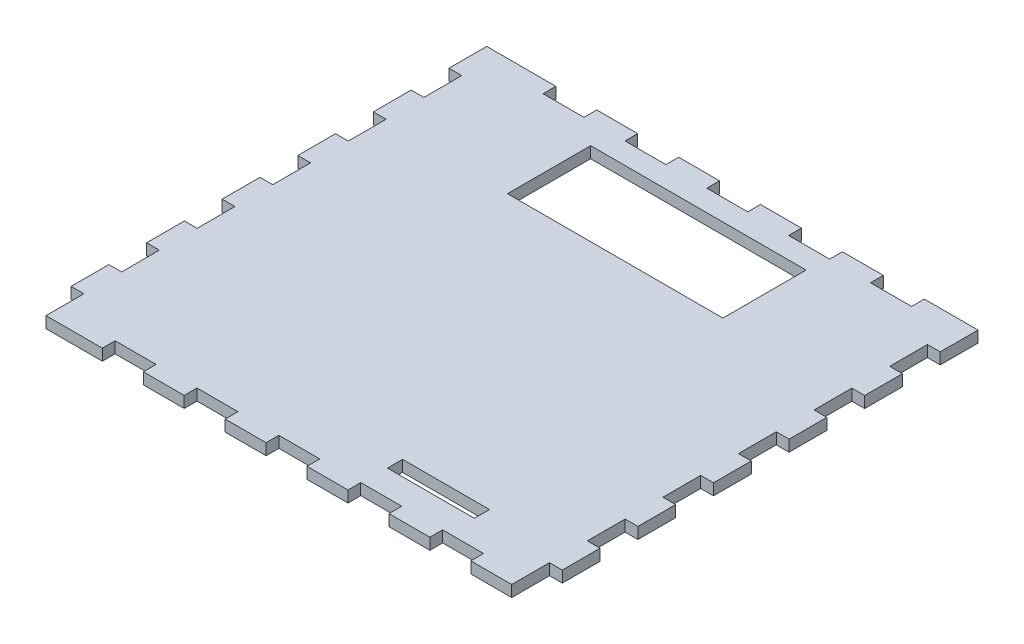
from build123d import *

# Parameters (mm, degrees)
SKETCH1_W           = 130
SKETCH1_H           = 120
SKETCH1_W_2         = 23
SKETCH1_H_2         = 4
BOSS_EXTRUDE1_DEPTH = 3
SKETCH3_W           = 57
SKETCH3_H           = 22
CUT_EXTRUDE1_DEPTH  = 3
SKETCH4_W           = 3.38
SKETCH4_H           = 10
CUT_EXTRUDE2_DEPTH  = 3
SKETCH5_W           = 10.833333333
SKETCH5_H           = 3.38
SKETCH5_W_2         = 10.833333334
CUT_EXTRUDE3_DEPTH  = 3


with BuildPart() as part:
    # Sketch1 → Boss-Extrude1 (new body)
    with BuildSketch(Plane(origin=(0, 0, 0), x_dir=(1, 0, 0), z_dir=(0, 1, 0))):
        Rectangle(SKETCH1_W, SKETCH1_H)
        with Locations((30, -47.764150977)):
            Rectangle(SKETCH1_W_2, SKETCH1_H_2, mode=Mode.SUBTRACT)
    extrude(amount=BOSS_EXTRUDE1_DEPTH)

    # Sketch3 → Cut-Extrude1 (cut)
    with BuildSketch(Plane(origin=(0, 3, 0), x_dir=(1, 0, 0), z_dir=(0, 1, 0))):
        with Locations((0, 40)):
            Rectangle(SKETCH3_W, SKETCH3_H)
    extrude(amount=-CUT_EXTRUDE1_DEPTH, mode=Mode.SUBTRACT)

    # Sketch4 → Cut-Extrude2 (cut)
    with BuildSketch(Plane(origin=(0, 3, 0), x_dir=(1, 0, 0), z_dir=(0, 1, 0))):
        with Locations((63.31, 25)):
            Rectangle(SKETCH4_W, SKETCH4_H)
        with Locations((63.31, 45)):
            Rectangle(SKETCH4_W, SKETCH4_H)
        with Locations((63.31, 5)):
            Rectangle(SKETCH4_W, SKETCH4_H)
        with Locations((63.31, -15)):
            Rectangle(SKETCH4_W, SKETCH4_H)
        with Locations((63.31, -55)):
            Rectangle(SKETCH4_W, SKETCH4_H)
        with Locations((63.31, -35)):
            Rectangle(SKETCH4_W, SKETCH4_H)
        with Locations((-63.31, -55)):
            Rectangle(SKETCH4_W, SKETCH4_H)
        with Locations((-63.31, -35)):
            Rectangle(SKETCH4_W, SKETCH4_H)
        with Locations((-63.31, -15)):
            Rectangle(SKETCH4_W, SKETCH4_H)
        with Locations((-63.31, 5)):
            Rectangle(SKETCH4_W, SKETCH4_H)
        with Locations((-63.31, 25)):
            Rectangle(SKETCH4_W, SKETCH4_H)
        with Locations((-63.31, 45)):
            Rectangle(SKETCH4_W, SKETCH4_H)
    extrude(amount=-CUT_EXTRUDE2_DEPTH, mode=Mode.SUBTRACT)

    # Sketch5 → Cut-Extrude3 (cut)
    with BuildSketch(Plane(origin=(0, 3, 0), x_dir=(1, 0, 0), z_dir=(0, 1, 0))):
        with Locations((-41.296666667, 58.31)):
            Rectangle(SKETCH5_W, SKETCH5_H)
        with Locations((-19.63, 58.31)):
            Rectangle(SKETCH5_W_2, SKETCH5_H)
        with Locations((2.036666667, 58.31)):
            Rectangle(SKETCH5_W, SKETCH5_H)
        with Locations((23.703333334, 58.31)):
            Rectangle(SKETCH5_W, SKETCH5_H)
        with Locations((45.37, 58.31)):
            Rectangle(SKETCH5_W_2, SKETCH5_H)
        with Locations((45.37, -58.31)):
            Rectangle(SKETCH5_W_2, SKETCH5_H)
        with Locations((23.703333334, -58.31)):
            Rectangle(SKETCH5_W, SKETCH5_H)
        with Locations((2.036666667, -58.31)):
            Rectangle(SKETCH5_W, SKETCH5_H)
        with Locations((-19.63, -58.31)):
            Rectangle(SKETCH5_W_2, SKETCH5_H)
        with Locations((-41.296666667, -58.31)):
            Rectangle(SKETCH5_W, SKETCH5_H)
    extrude(amount=-CUT_EXTRUDE3_DEPTH, mode=Mode.SUBTRACT)


solid = part.part
